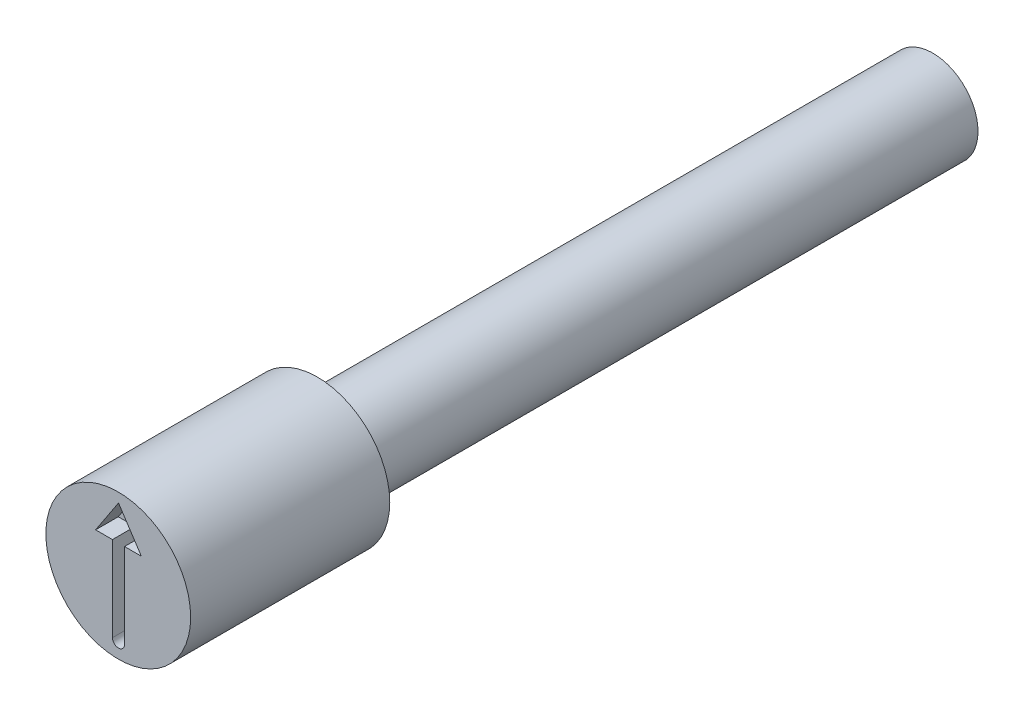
from build123d import *

# Parameters (mm, degrees)
CUT_EXTRUDE4_DEPTH = 0.25


with BuildPart() as part:
    # Sketch2 → Revolve1 (revolve)
    with BuildSketch(Plane(origin=(0, 0, 0), x_dir=(0, 0, -1), z_dir=(1, 0, 0)), mode=Mode.PRIVATE) as revolve1_sk:
        Polygon((0, 0.8), (0, 0), (9, 0), (9, 0.5), (2.2, 0.5), (2.2, 0.8), align=None)
    revolve(revolve1_sk.sketch.rotate(Axis((0, 0, -0.403888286), (0, 0, -1)), 90), axis=Axis((0, 0, -0.403888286), (0, 0, -1)))

    # Sketch3 → Cut-Extrude4 (cut)
    with BuildSketch(Plane.XY):
        with BuildLine():
            Line((0.069168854, 0.31237424), (0.069168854, -0.626505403))
            ThreePointArc((0.069168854, -0.626505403), (0.002503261, -0.693170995), (-0.064162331, -0.626505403))
            Line((-0.064162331, -0.626505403), (-0.064162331, 0.31237424))
            Line((-0.064162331, 0.31237424), (-0.250167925, 0.31237424))
            Line((-0.250167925, 0.31237424), (0.002503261, 0.69589161))
            Line((0.002503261, 0.69589161), (0.255174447, 0.31237424))
            Line((0.255174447, 0.31237424), (0.069168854, 0.31237424))
        make_face()
    extrude(amount=-CUT_EXTRUDE4_DEPTH, mode=Mode.SUBTRACT)


solid = part.part
